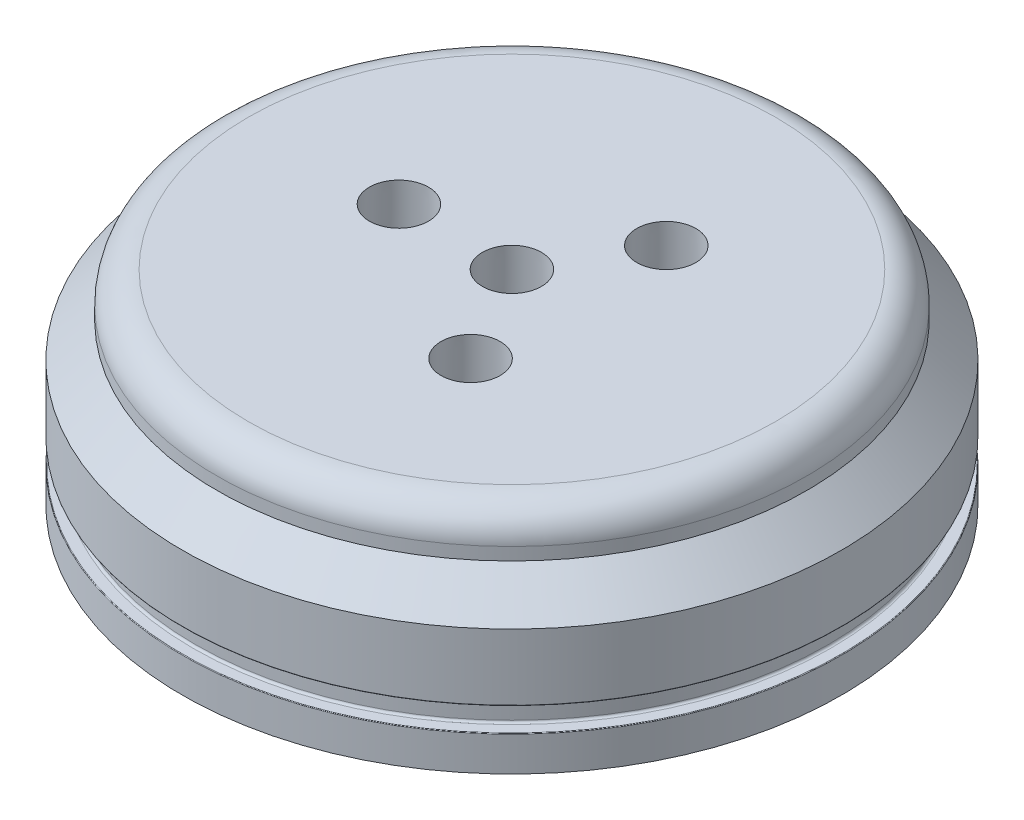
from build123d import *

# Parameters (mm, degrees)
CIRPATTERN1_COUNT              = 3
FILLET1_R                      = 6.35
F_8_32_TAPPED_HOLE1_AT_2_COUNT = 2
F_8_32_TAPPED_HOLE1_AT_2_PITCH = 19.05
CIRPATTERN3_COUNT              = 5


with BuildPart() as part:
    # Sketch1 → Revolve1 (revolve)
    with BuildSketch(Plane.XY, mode=Mode.PRIVATE) as revolve1_sk:
        with BuildLine():
            Line((-66.675, 0), (-66.675, 6.985))
            ThreePointArc((-66.675, 6.985), (-66.637802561, 7.074802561), (-66.548, 7.112))
            Line((-66.548, 7.112), (-64.4779, 7.112))
            ThreePointArc((-64.4779, 7.112), (-64.163591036, 7.242191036), (-64.0334, 7.5565))
            Line((-64.0334, 7.5565), (-64.0334, 11.4935))
            ThreePointArc((-64.0334, 11.4935), (-64.163591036, 11.807808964), (-64.4779, 11.938))
            Line((-64.4779, 11.938), (-66.548, 11.938))
            ThreePointArc((-66.548, 11.938), (-66.637802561, 11.975197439), (-66.675, 12.065))
            Line((-66.675, 12.065), (-66.675, 25.4))
            Line((-66.675, 25.4), (-59.69, 32.385))
            Line((-59.69, 32.385), (-59.69, 41.275))
            Line((-59.69, 41.275), (0, 41.275))
            Line((0, 41.275), (0, 32.385))
            Line((0, 32.385), (-42.253106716, 32.385))
            ThreePointArc((-42.253106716, 32.385), (-48.296672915, 29.881672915), (-50.8, 23.838106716))
            Line((-50.8, 23.838106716), (-50.8, 0))
            Line((-50.8, 0), (-66.675, 0))
        make_face()
    revolve(revolve1_sk.sketch.rotate(Axis((0, 0, 0), (0, 1, 0)), 270), axis=Axis((0, 0, 0), (0, 1, 0)))

    # Sketch2 → 1_4 NPT Tapped Hole1 (revolve, cut)
    with BuildSketch(Plane(origin=(-22.86, 32.385, 0), x_dir=(0, 0, -1), z_dir=(1, 0, 0))):
        Polygon((0, 0), (0, 8.89), (5.5626, 8.89), (5.5626, 10.033), (5.943680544, 10.033), (6.244082, 0), align=None)
    f_1_4_npt_tapped_hole1 = revolve(axis=Axis((-22.86, 26.035, 0), (0, 1, 0)), mode=Mode.SUBTRACT)

    # CirPattern1: 1_4 NPT Tapped Hole1 ×3 about axis
    cirpattern1_axis = Axis((0, 0, 0), (0, 1, 0))
    for i in range(1, CIRPATTERN1_COUNT):
        add(f_1_4_npt_tapped_hole1.rotate(cirpattern1_axis, i * 360 / CIRPATTERN1_COUNT), mode=Mode.SUBTRACT)

    # Fillet1
    fillet1_edges = [part.edges().sort_by_distance(p)[0] for p in [
        (0, 41.275, 59.69),
    ]]
    fillet(fillet1_edges, radius=FILLET1_R)

    # Sketch10 → 8-32 Tapped Hole1 (revolve, cut)
    with BuildSketch(Plane(origin=(-57.960057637, 0, -9.525), x_dir=(0, 0, -1), z_dir=(1, 0, 0))):
        Polygon((0, 0), (0, 13.331406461), (1.7272, 12.2936), (1.7272, 0), align=None)
    f_8_32_tapped_hole1 = revolve(axis=Axis((-57.960057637, -6.35, -9.525), (0, 1, 0)), mode=Mode.SUBTRACT)

    # 8-32 Tapped Hole1 at 2: 8-32 Tapped Hole1 ×2
    with Locations(*[(0, 0, i * F_8_32_TAPPED_HOLE1_AT_2_PITCH) for i in range(1, F_8_32_TAPPED_HOLE1_AT_2_COUNT)]):
        add(f_8_32_tapped_hole1, mode=Mode.SUBTRACT)

    # CirPattern3: 8-32 Tapped Hole1 ×5 about axis
    cirpattern3_axis = Axis((0, 0, 0), (0, 1, 0))
    for i in range(1, CIRPATTERN3_COUNT):
        add(f_8_32_tapped_hole1.rotate(cirpattern3_axis, i * 360 / CIRPATTERN3_COUNT), mode=Mode.SUBTRACT)

    # CirPattern3 copy 1 sketch → CirPattern3 copy 1 (revolve, cut)
    with BuildSketch(Plane(origin=(-8.851829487, 0, 58.066677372), x_dir=(-0.9510565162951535, 0, -0.30901699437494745), z_dir=(0.30901699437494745, 0, -0.9510565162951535))):
        Polygon((0, 0), (0, 13.331406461), (1.7272, 12.2936), (1.7272, 0), align=None)
    revolve(axis=Axis((-8.851829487, -6.35, 58.066677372), (0, 1, 0)), mode=Mode.SUBTRACT)

    # CirPattern3 copy 2 sketch → CirPattern3 copy 2 (revolve, cut)
    with BuildSketch(Plane(origin=(52.489326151, 0, 26.362180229), x_dir=(-0.5877852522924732, 0, 0.8090169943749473), z_dir=(-0.8090169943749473, 0, -0.5877852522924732))):
        Polygon((0, 0), (0, 13.331406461), (1.7272, 12.2936), (1.7272, 0), align=None)
    revolve(axis=Axis((52.489326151, -6.35, 26.362180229), (0, 1, 0)), mode=Mode.SUBTRACT)

    # CirPattern3 copy 3 sketch → CirPattern3 copy 3 (revolve, cut)
    with BuildSketch(Plane(origin=(41.292017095, 0, -41.773953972), x_dir=(0.587785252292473, 0, 0.8090169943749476), z_dir=(-0.8090169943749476, 0, 0.587785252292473))):
        Polygon((0, 0), (0, 13.331406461), (1.7272, 12.2936), (1.7272, 0), align=None)
    revolve(axis=Axis((41.292017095, -6.35, -41.773953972), (0, 1, 0)), mode=Mode.SUBTRACT)

    # CirPattern3 copy 4 sketch → CirPattern3 copy 4 (revolve, cut)
    with BuildSketch(Plane(origin=(-26.969456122, 0, -52.179903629), x_dir=(0.9510565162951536, 0, -0.30901699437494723), z_dir=(0.30901699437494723, 0, 0.9510565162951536))):
        Polygon((0, 0), (0, 13.331406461), (1.7272, 12.2936), (1.7272, 0), align=None)
    revolve(axis=Axis((-26.969456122, -6.35, -52.179903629), (0, 1, 0)), mode=Mode.SUBTRACT)

    # Sketch18 → 1_4 NPT Tapped Hole2 (revolve, cut)
    with BuildSketch(Plane(origin=(0, 32.385, 0), x_dir=(0, 0, -1), z_dir=(1, 0, 0))):
        Polygon((0, 0), (0, 8.89), (5.5626, 8.89), (5.5626, 10.033), (5.943680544, 10.033), (6.244082, 0), align=None)
    revolve(axis=Axis((0, 26.035, 0), (0, 1, 0)), mode=Mode.SUBTRACT)


solid = part.part
